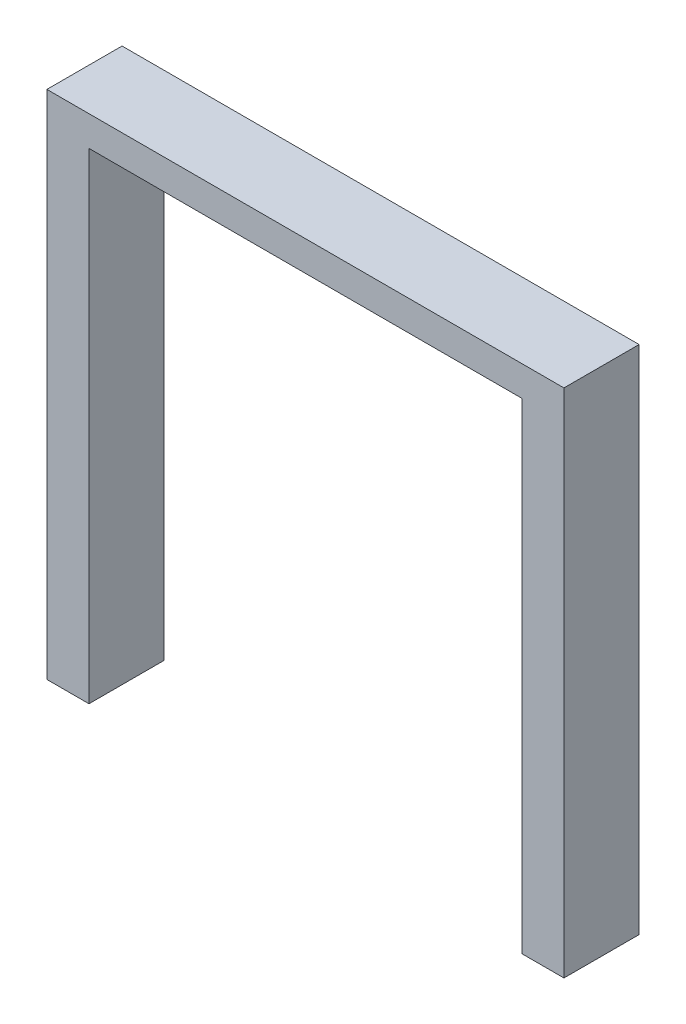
from build123d import *

# Parameters (mm, degrees)
BOSS_EXTRUDE1_DEPTH = 6.25


with BuildPart() as part:
    # Sketch1 → Boss-Extrude1 (new, symmetric)
    with BuildSketch(Plane.XY):
        Polygon((-36, 0), (-43, 0), (-43, 85), (43, 85), (43, 0), (36, 0), (36, 80), (-36, 80), align=None)
    extrude(amount=BOSS_EXTRUDE1_DEPTH, both=True)


solid = part.part
